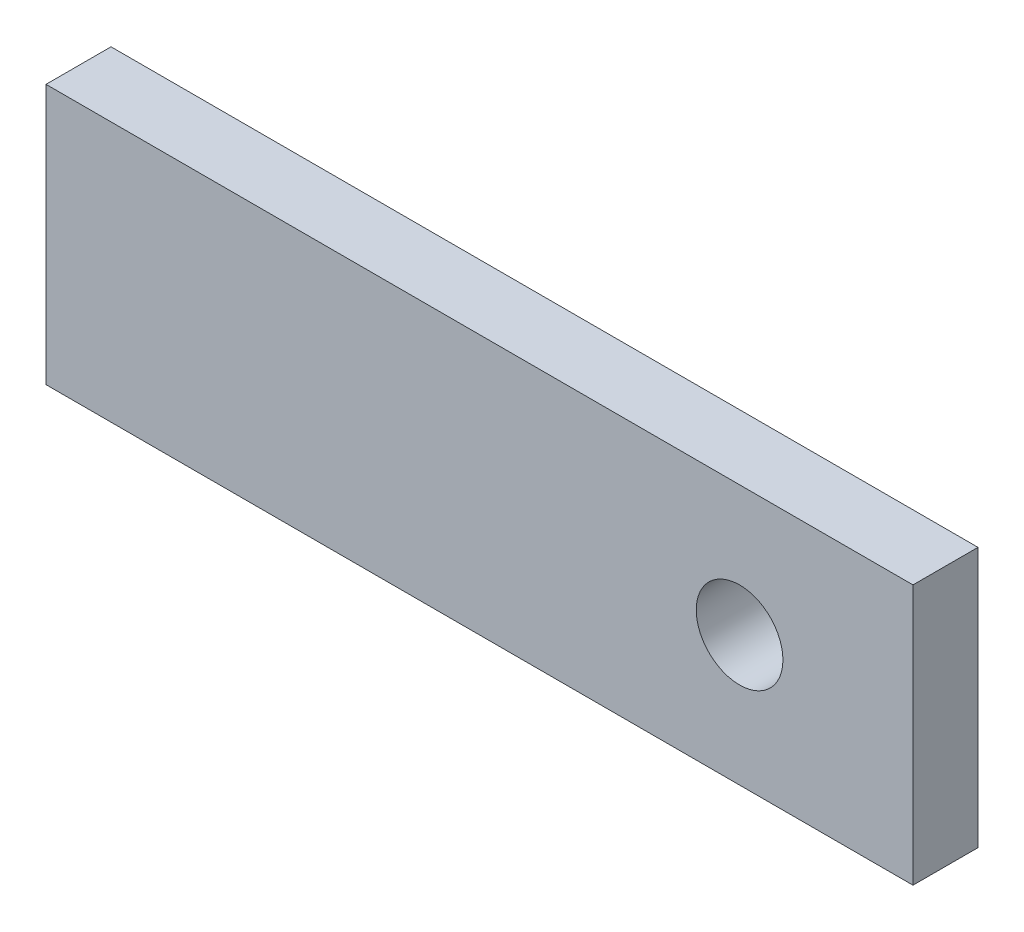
ISO-10303-21;
HEADER;
FILE_DESCRIPTION(('STEP AP214'),'2;1');
FILE_NAME('part.step','',(''),(''),'','','');
FILE_SCHEMA(('AUTOMOTIVE_DESIGN { 1 0 10303 214 1 1 1 1 }'));
ENDSEC;
DATA;
#1=APPLICATION_CONTEXT('core data for automotive mechanical design processes');
#2=APPLICATION_PROTOCOL_DEFINITION('international standard','automotive_design',2000,#1);
#3=PRODUCT_CONTEXT('',#1,'mechanical');
#4=PRODUCT('Part','Part','',(#3));
#5=PRODUCT_RELATED_PRODUCT_CATEGORY('part','',(#4));
#6=PRODUCT_DEFINITION_FORMATION('','',#4);
#7=PRODUCT_DEFINITION_CONTEXT('part definition',#1,'design');
#8=PRODUCT_DEFINITION('design','',#6,#7);
#9=PRODUCT_DEFINITION_SHAPE('','',#8);
#10=(LENGTH_UNIT() NAMED_UNIT(*) SI_UNIT(.MILLI.,.METRE.));
#11=(NAMED_UNIT(*) PLANE_ANGLE_UNIT() SI_UNIT($,.RADIAN.));
#12=(NAMED_UNIT(*) SI_UNIT($,.STERADIAN.) SOLID_ANGLE_UNIT());
#13=UNCERTAINTY_MEASURE_WITH_UNIT(LENGTH_MEASURE(1.E-05),#10,'distance_accuracy_value','');
#14=(GEOMETRIC_REPRESENTATION_CONTEXT(3) GLOBAL_UNCERTAINTY_ASSIGNED_CONTEXT((#13)) GLOBAL_UNIT_ASSIGNED_CONTEXT((#10,
#11,#12)) REPRESENTATION_CONTEXT('',''));
#15=CARTESIAN_POINT('',(0.,0.,0.));
#16=DIRECTION('',(0.,0.,1.));
#17=DIRECTION('',(1.,0.,0.));
#18=AXIS2_PLACEMENT_3D('',#15,#16,#17);
#19=CARTESIAN_POINT('',(0.,0.,3.));
#20=DIRECTION('',(0.,0.,1.));
#21=DIRECTION('',(1.,0.,0.));
#22=AXIS2_PLACEMENT_3D('',#19,#20,#21);
#23=PLANE('',#22);
#24=CARTESIAN_POINT('',(12.,0.,3.));
#25=DIRECTION('',(0.,0.,1.));
#26=DIRECTION('',(1.,0.,0.));
#27=AXIS2_PLACEMENT_3D('',#24,#25,#26);
#28=CIRCLE('',#27,2.);
#29=CARTESIAN_POINT('',(14.,0.,3.));
#30=VERTEX_POINT('',#29);
#31=EDGE_CURVE('E25',#30,#30,#28,.T.);
#32=ORIENTED_EDGE('',*,*,#31,.F.);
#33=EDGE_LOOP('',(#32));
#34=FACE_BOUND('',#33,.T.);
#35=DIRECTION('',(1.,0.,0.));
#36=VECTOR('',#35,1.);
#37=CARTESIAN_POINT('',(-20.,-6.,3.));
#38=LINE('',#37,#36);
#39=CARTESIAN_POINT('',(-20.,-6.,3.));
#40=VERTEX_POINT('',#39);
#41=CARTESIAN_POINT('',(20.,-6.,3.));
#42=VERTEX_POINT('',#41);
#43=EDGE_CURVE('E97',#40,#42,#38,.T.);
#44=ORIENTED_EDGE('',*,*,#43,.T.);
#45=DIRECTION('',(0.,1.,0.));
#46=VECTOR('',#45,1.);
#47=CARTESIAN_POINT('',(20.,-6.,3.));
#48=LINE('',#47,#46);
#49=CARTESIAN_POINT('',(20.,6.,3.));
#50=VERTEX_POINT('',#49);
#51=EDGE_CURVE('E122',#42,#50,#48,.T.);
#52=ORIENTED_EDGE('',*,*,#51,.T.);
#53=DIRECTION('',(-1.,0.,0.));
#54=VECTOR('',#53,1.);
#55=CARTESIAN_POINT('',(20.,6.,3.));
#56=LINE('',#55,#54);
#57=CARTESIAN_POINT('',(-20.,6.,3.));
#58=VERTEX_POINT('',#57);
#59=EDGE_CURVE('E89',#50,#58,#56,.T.);
#60=ORIENTED_EDGE('',*,*,#59,.T.);
#61=DIRECTION('',(0.,-1.,0.));
#62=VECTOR('',#61,1.);
#63=CARTESIAN_POINT('',(-20.,6.,3.));
#64=LINE('',#63,#62);
#65=EDGE_CURVE('E19',#58,#40,#64,.T.);
#66=ORIENTED_EDGE('',*,*,#65,.T.);
#67=EDGE_LOOP('',(#44,#52,#60,#66));
#68=FACE_BOUND('',#67,.T.);
#69=ADVANCED_FACE('F16',(#34,#68),#23,.T.);
#70=CARTESIAN_POINT('',(0.,0.,0.));
#71=DIRECTION('',(0.,0.,1.));
#72=DIRECTION('',(1.,0.,0.));
#73=AXIS2_PLACEMENT_3D('',#70,#71,#72);
#74=PLANE('',#73);
#75=CARTESIAN_POINT('',(12.,0.,0.));
#76=DIRECTION('',(0.,0.,1.));
#77=DIRECTION('',(1.,0.,0.));
#78=AXIS2_PLACEMENT_3D('',#75,#76,#77);
#79=CIRCLE('',#78,2.);
#80=CARTESIAN_POINT('',(14.,0.,0.));
#81=VERTEX_POINT('',#80);
#82=EDGE_CURVE('E10',#81,#81,#79,.T.);
#83=ORIENTED_EDGE('',*,*,#82,.T.);
#84=EDGE_LOOP('',(#83));
#85=FACE_BOUND('',#84,.T.);
#86=DIRECTION('',(0.,-1.,0.));
#87=VECTOR('',#86,1.);
#88=CARTESIAN_POINT('',(-20.,6.,0.));
#89=LINE('',#88,#87);
#90=CARTESIAN_POINT('',(-20.,6.,0.));
#91=VERTEX_POINT('',#90);
#92=CARTESIAN_POINT('',(-20.,-6.,0.));
#93=VERTEX_POINT('',#92);
#94=EDGE_CURVE('E78',#91,#93,#89,.T.);
#95=ORIENTED_EDGE('',*,*,#94,.F.);
#96=DIRECTION('',(-1.,0.,0.));
#97=VECTOR('',#96,1.);
#98=CARTESIAN_POINT('',(20.,6.,0.));
#99=LINE('',#98,#97);
#100=CARTESIAN_POINT('',(20.,6.,0.));
#101=VERTEX_POINT('',#100);
#102=EDGE_CURVE('E119',#101,#91,#99,.T.);
#103=ORIENTED_EDGE('',*,*,#102,.F.);
#104=DIRECTION('',(0.,1.,0.));
#105=VECTOR('',#104,1.);
#106=CARTESIAN_POINT('',(20.,-6.,0.));
#107=LINE('',#106,#105);
#108=CARTESIAN_POINT('',(20.,-6.,0.));
#109=VERTEX_POINT('',#108);
#110=EDGE_CURVE('E99',#109,#101,#107,.T.);
#111=ORIENTED_EDGE('',*,*,#110,.F.);
#112=DIRECTION('',(1.,0.,0.));
#113=VECTOR('',#112,1.);
#114=CARTESIAN_POINT('',(-20.,-6.,0.));
#115=LINE('',#114,#113);
#116=EDGE_CURVE('E95',#93,#109,#115,.T.);
#117=ORIENTED_EDGE('',*,*,#116,.F.);
#118=EDGE_LOOP('',(#95,#103,#111,#117));
#119=FACE_BOUND('',#118,.T.);
#120=ADVANCED_FACE('F101',(#85,#119),#74,.F.);
#121=CARTESIAN_POINT('',(12.,0.,0.));
#122=DIRECTION('',(0.,0.,-1.));
#123=DIRECTION('',(1.,0.,0.));
#124=AXIS2_PLACEMENT_3D('',#121,#122,#123);
#125=CYLINDRICAL_SURFACE('',#124,2.);
#126=DIRECTION('',(0.,0.,1.));
#127=VECTOR('',#126,1.);
#128=CARTESIAN_POINT('',(14.,0.,0.));
#129=LINE('',#128,#127);
#130=EDGE_CURVE('E112',#81,#30,#129,.T.);
#131=ORIENTED_EDGE('',*,*,#130,.T.);
#132=ORIENTED_EDGE('',*,*,#31,.T.);
#133=ORIENTED_EDGE('',*,*,#130,.F.);
#134=ORIENTED_EDGE('',*,*,#82,.F.);
#135=EDGE_LOOP('',(#131,#132,#133,#134));
#136=FACE_BOUND('',#135,.T.);
#137=ADVANCED_FACE('F171',(#136),#125,.F.);
#138=CARTESIAN_POINT('',(-20.,6.,0.));
#139=DIRECTION('',(1.,0.,0.));
#140=DIRECTION('',(0.,1.,0.));
#141=AXIS2_PLACEMENT_3D('',#138,#139,#140);
#142=PLANE('',#141);
#143=ORIENTED_EDGE('',*,*,#94,.T.);
#144=DIRECTION('',(0.,0.,1.));
#145=VECTOR('',#144,1.);
#146=CARTESIAN_POINT('',(-20.,-6.,0.));
#147=LINE('',#146,#145);
#148=EDGE_CURVE('E81',#93,#40,#147,.T.);
#149=ORIENTED_EDGE('',*,*,#148,.T.);
#150=ORIENTED_EDGE('',*,*,#65,.F.);
#151=DIRECTION('',(0.,0.,1.));
#152=VECTOR('',#151,1.);
#153=CARTESIAN_POINT('',(-20.,6.,0.));
#154=LINE('',#153,#152);
#155=EDGE_CURVE('E84',#91,#58,#154,.T.);
#156=ORIENTED_EDGE('',*,*,#155,.F.);
#157=EDGE_LOOP('',(#143,#149,#150,#156));
#158=FACE_BOUND('',#157,.T.);
#159=ADVANCED_FACE('F80',(#158),#142,.F.);
#160=CARTESIAN_POINT('',(20.,6.,0.));
#161=DIRECTION('',(0.,-1.,0.));
#162=DIRECTION('',(0.,0.,-1.));
#163=AXIS2_PLACEMENT_3D('',#160,#161,#162);
#164=PLANE('',#163);
#165=ORIENTED_EDGE('',*,*,#102,.T.);
#166=ORIENTED_EDGE('',*,*,#155,.T.);
#167=ORIENTED_EDGE('',*,*,#59,.F.);
#168=DIRECTION('',(0.,0.,1.));
#169=VECTOR('',#168,1.);
#170=CARTESIAN_POINT('',(20.,6.,0.));
#171=LINE('',#170,#169);
#172=EDGE_CURVE('E117',#101,#50,#171,.T.);
#173=ORIENTED_EDGE('',*,*,#172,.F.);
#174=EDGE_LOOP('',(#165,#166,#167,#173));
#175=FACE_BOUND('',#174,.T.);
#176=ADVANCED_FACE('F154',(#175),#164,.F.);
#177=CARTESIAN_POINT('',(20.,-6.,0.));
#178=DIRECTION('',(-1.,0.,0.));
#179=DIRECTION('',(0.,0.,1.));
#180=AXIS2_PLACEMENT_3D('',#177,#178,#179);
#181=PLANE('',#180);
#182=ORIENTED_EDGE('',*,*,#110,.T.);
#183=ORIENTED_EDGE('',*,*,#172,.T.);
#184=ORIENTED_EDGE('',*,*,#51,.F.);
#185=DIRECTION('',(0.,0.,1.));
#186=VECTOR('',#185,1.);
#187=CARTESIAN_POINT('',(20.,-6.,0.));
#188=LINE('',#187,#186);
#189=EDGE_CURVE('E105',#109,#42,#188,.T.);
#190=ORIENTED_EDGE('',*,*,#189,.F.);
#191=EDGE_LOOP('',(#182,#183,#184,#190));
#192=FACE_BOUND('',#191,.T.);
#193=ADVANCED_FACE('F145',(#192),#181,.F.);
#194=CARTESIAN_POINT('',(-20.,-6.,0.));
#195=DIRECTION('',(0.,1.,0.));
#196=DIRECTION('',(1.,0.,0.));
#197=AXIS2_PLACEMENT_3D('',#194,#195,#196);
#198=PLANE('',#197);
#199=ORIENTED_EDGE('',*,*,#116,.T.);
#200=ORIENTED_EDGE('',*,*,#189,.T.);
#201=ORIENTED_EDGE('',*,*,#43,.F.);
#202=ORIENTED_EDGE('',*,*,#148,.F.);
#203=EDGE_LOOP('',(#199,#200,#201,#202));
#204=FACE_BOUND('',#203,.T.);
#205=ADVANCED_FACE('F93',(#204),#198,.F.);
#206=CLOSED_SHELL('',(#69,#120,#137,#159,#176,#193,#205));
#207=MANIFOLD_SOLID_BREP('B1',#206);
#208=ADVANCED_BREP_SHAPE_REPRESENTATION('',(#18,#207),#14);
#209=SHAPE_DEFINITION_REPRESENTATION(#9,#208);
ENDSEC;
END-ISO-10303-21;
